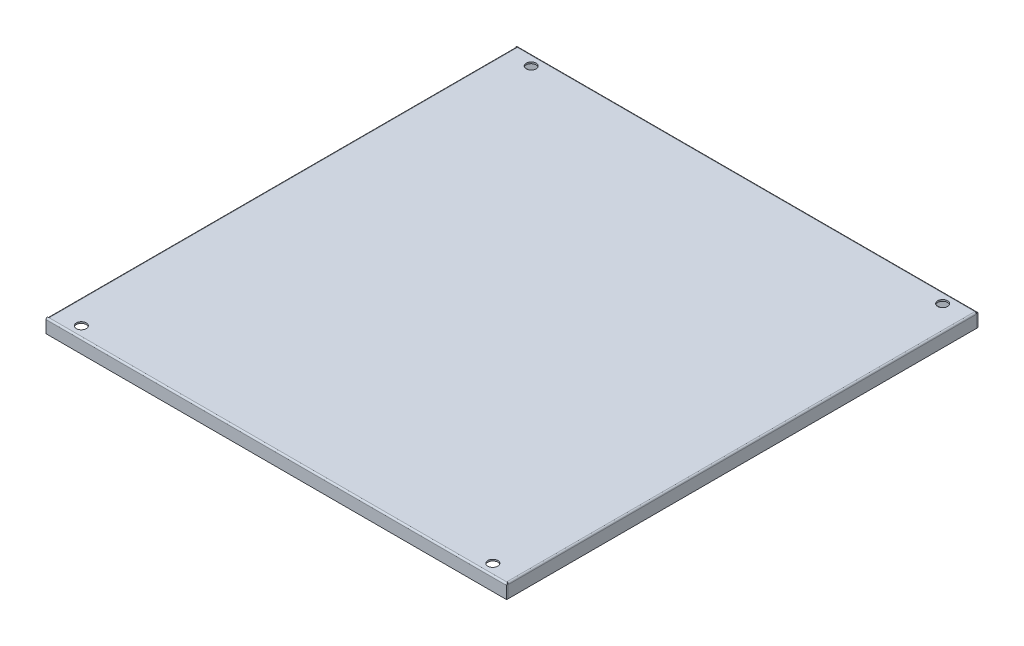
ISO-10303-21;
HEADER;
FILE_DESCRIPTION(('STEP AP214'),'2;1');
FILE_NAME('part.step','',(''),(''),'','','');
FILE_SCHEMA(('AUTOMOTIVE_DESIGN { 1 0 10303 214 1 1 1 1 }'));
ENDSEC;
DATA;
#1=APPLICATION_CONTEXT('core data for automotive mechanical design processes');
#2=APPLICATION_PROTOCOL_DEFINITION('international standard','automotive_design',2000,#1);
#3=PRODUCT_CONTEXT('',#1,'mechanical');
#4=PRODUCT('Part','Part','',(#3));
#5=PRODUCT_RELATED_PRODUCT_CATEGORY('part','',(#4));
#6=PRODUCT_DEFINITION_FORMATION('','',#4);
#7=PRODUCT_DEFINITION_CONTEXT('part definition',#1,'design');
#8=PRODUCT_DEFINITION('design','',#6,#7);
#9=PRODUCT_DEFINITION_SHAPE('','',#8);
#10=(LENGTH_UNIT() NAMED_UNIT(*) SI_UNIT(.MILLI.,.METRE.));
#11=(NAMED_UNIT(*) PLANE_ANGLE_UNIT() SI_UNIT($,.RADIAN.));
#12=(NAMED_UNIT(*) SI_UNIT($,.STERADIAN.) SOLID_ANGLE_UNIT());
#13=UNCERTAINTY_MEASURE_WITH_UNIT(LENGTH_MEASURE(1.E-05),#10,'distance_accuracy_value','');
#14=(GEOMETRIC_REPRESENTATION_CONTEXT(3) GLOBAL_UNCERTAINTY_ASSIGNED_CONTEXT((#13)) GLOBAL_UNIT_ASSIGNED_CONTEXT((#10,
#11,#12)) REPRESENTATION_CONTEXT('',''));
#15=CARTESIAN_POINT('',(0.,0.,0.));
#16=DIRECTION('',(0.,0.,1.));
#17=DIRECTION('',(1.,0.,0.));
#18=AXIS2_PLACEMENT_3D('',#15,#16,#17);
#19=CARTESIAN_POINT('',(300.,0.,304.95));
#20=DIRECTION('',(0.,0.,-1.));
#21=DIRECTION('',(0.,1.,0.));
#22=AXIS2_PLACEMENT_3D('',#19,#20,#21);
#23=PLANE('',#22);
#24=DIRECTION('',(0.,1.,0.));
#25=VECTOR('',#24,1.);
#26=CARTESIAN_POINT('',(300.,0.,304.95));
#27=LINE('',#26,#25);
#28=CARTESIAN_POINT('',(299.999390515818,-1.48654678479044E-05,304.95));
#29=VERTEX_POINT('',#28);
#30=CARTESIAN_POINT('',(300.,2.,304.95));
#31=VERTEX_POINT('',#30);
#32=EDGE_CURVE('E521',#29,#31,#27,.T.);
#33=ORIENTED_EDGE('',*,*,#32,.F.);
#34=CARTESIAN_POINT('',(297.95,-0.0499999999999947,304.95));
#35=DIRECTION('',(0.,0.,1.));
#36=DIRECTION('',(1.,0.,0.));
#37=AXIS2_PLACEMENT_3D('',#34,#35,#36);
#38=CIRCLE('',#37,2.04999999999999);
#39=CARTESIAN_POINT('',(297.95,2.,304.95));
#40=VERTEX_POINT('',#39);
#41=EDGE_CURVE('E13',#29,#40,#38,.T.);
#42=ORIENTED_EDGE('',*,*,#41,.T.);
#43=DIRECTION('',(-1.,0.,0.));
#44=VECTOR('',#43,1.);
#45=CARTESIAN_POINT('',(-300.,2.,304.95));
#46=LINE('',#45,#44);
#47=EDGE_CURVE('E464',#31,#40,#46,.T.);
#48=ORIENTED_EDGE('',*,*,#47,.F.);
#49=EDGE_LOOP('',(#33,#42,#48));
#50=FACE_BOUND('',#49,.T.);
#51=ADVANCED_FACE('F119',(#50),#23,.T.);
#52=CARTESIAN_POINT('',(297.95,0.,-304.95));
#53=DIRECTION('',(1.62471662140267E-13,0.,1.));
#54=DIRECTION('',(1.,0.,-1.62471662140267E-13));
#55=AXIS2_PLACEMENT_3D('',#52,#53,#54);
#56=PLANE('',#55);
#57=DIRECTION('',(1.,0.,0.));
#58=VECTOR('',#57,1.);
#59=CARTESIAN_POINT('',(300.,2.,-304.95));
#60=LINE('',#59,#58);
#61=CARTESIAN_POINT('',(300.,2.,-304.95));
#62=VERTEX_POINT('',#61);
#63=CARTESIAN_POINT('',(297.95,2.,-304.949999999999));
#64=VERTEX_POINT('',#63);
#65=EDGE_CURVE('E493',#62,#64,#60,.F.);
#66=ORIENTED_EDGE('',*,*,#65,.T.);
#67=CARTESIAN_POINT('',(297.95,-0.0499999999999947,-304.949999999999));
#68=DIRECTION('',(0.,0.,1.));
#69=DIRECTION('',(1.,0.,0.));
#70=AXIS2_PLACEMENT_3D('',#67,#68,#69);
#71=CIRCLE('',#70,2.04999999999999);
#72=CARTESIAN_POINT('',(299.999390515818,-1.48654678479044E-05,-304.949999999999));
#73=VERTEX_POINT('',#72);
#74=EDGE_CURVE('E392',#64,#73,#71,.F.);
#75=ORIENTED_EDGE('',*,*,#74,.T.);
#76=DIRECTION('',(0.,1.,0.));
#77=VECTOR('',#76,1.);
#78=CARTESIAN_POINT('',(300.,0.,-304.95));
#79=LINE('',#78,#77);
#80=EDGE_CURVE('E499',#73,#62,#79,.T.);
#81=ORIENTED_EDGE('',*,*,#80,.T.);
#82=EDGE_LOOP('',(#66,#75,#81));
#83=FACE_BOUND('',#82,.T.);
#84=ADVANCED_FACE('F591',(#83),#56,.T.);
#85=CARTESIAN_POINT('',(-300.,0.,-304.95));
#86=DIRECTION('',(0.,0.,1.));
#87=DIRECTION('',(0.,-1.,0.));
#88=AXIS2_PLACEMENT_3D('',#85,#86,#87);
#89=PLANE('',#88);
#90=DIRECTION('',(0.,1.,0.));
#91=VECTOR('',#90,1.);
#92=CARTESIAN_POINT('',(-300.,0.,-304.95));
#93=LINE('',#92,#91);
#94=CARTESIAN_POINT('',(-299.999390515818,-1.48654678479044E-05,-304.95));
#95=VERTEX_POINT('',#94);
#96=CARTESIAN_POINT('',(-300.,2.,-304.95));
#97=VERTEX_POINT('',#96);
#98=EDGE_CURVE('E514',#95,#97,#93,.T.);
#99=ORIENTED_EDGE('',*,*,#98,.F.);
#100=CARTESIAN_POINT('',(-297.95,-0.0499999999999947,-304.95));
#101=DIRECTION('',(0.,0.,-1.));
#102=DIRECTION('',(-1.,0.,0.));
#103=AXIS2_PLACEMENT_3D('',#100,#101,#102);
#104=CIRCLE('',#103,2.04999999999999);
#105=CARTESIAN_POINT('',(-297.95,2.,-304.95));
#106=VERTEX_POINT('',#105);
#107=EDGE_CURVE('E128',#95,#106,#104,.T.);
#108=ORIENTED_EDGE('',*,*,#107,.T.);
#109=DIRECTION('',(1.,0.,0.));
#110=VECTOR('',#109,1.);
#111=CARTESIAN_POINT('',(300.,2.,-304.95));
#112=LINE('',#111,#110);
#113=EDGE_CURVE('E248',#97,#106,#112,.T.);
#114=ORIENTED_EDGE('',*,*,#113,.F.);
#115=EDGE_LOOP('',(#99,#108,#114));
#116=FACE_BOUND('',#115,.T.);
#117=ADVANCED_FACE('F597',(#116),#89,.T.);
#118=CARTESIAN_POINT('',(-297.95,0.,304.95));
#119=DIRECTION('',(-1.62471662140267E-13,0.,-1.));
#120=DIRECTION('',(-1.,0.,1.62471662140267E-13));
#121=AXIS2_PLACEMENT_3D('',#118,#119,#120);
#122=PLANE('',#121);
#123=DIRECTION('',(-1.,0.,0.));
#124=VECTOR('',#123,1.);
#125=CARTESIAN_POINT('',(-300.,2.,304.95));
#126=LINE('',#125,#124);
#127=CARTESIAN_POINT('',(-300.,2.,304.95));
#128=VERTEX_POINT('',#127);
#129=CARTESIAN_POINT('',(-297.95,2.,304.949999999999));
#130=VERTEX_POINT('',#129);
#131=EDGE_CURVE('E738',#128,#130,#126,.F.);
#132=ORIENTED_EDGE('',*,*,#131,.T.);
#133=CARTESIAN_POINT('',(-297.95,-0.0499999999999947,304.949999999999));
#134=DIRECTION('',(0.,0.,-1.));
#135=DIRECTION('',(-1.,0.,0.));
#136=AXIS2_PLACEMENT_3D('',#133,#134,#135);
#137=CIRCLE('',#136,2.04999999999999);
#138=CARTESIAN_POINT('',(-299.999390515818,-1.48654678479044E-05,304.949999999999));
#139=VERTEX_POINT('',#138);
#140=EDGE_CURVE('E449',#130,#139,#137,.F.);
#141=ORIENTED_EDGE('',*,*,#140,.T.);
#142=DIRECTION('',(0.,1.,0.));
#143=VECTOR('',#142,1.);
#144=CARTESIAN_POINT('',(-300.,0.,304.95));
#145=LINE('',#144,#143);
#146=EDGE_CURVE('E241',#139,#128,#145,.T.);
#147=ORIENTED_EDGE('',*,*,#146,.T.);
#148=EDGE_LOOP('',(#132,#141,#147));
#149=FACE_BOUND('',#148,.T.);
#150=ADVANCED_FACE('F602',(#149),#122,.T.);
#151=CARTESIAN_POINT('',(300.,2.,-307.));
#152=DIRECTION('',(0.,-1.,0.));
#153=DIRECTION('',(0.,0.,-1.));
#154=AXIS2_PLACEMENT_3D('',#151,#152,#153);
#155=PLANE('',#154);
#156=CARTESIAN_POINT('',(268.,2.,293.));
#157=DIRECTION('',(0.,1.,0.));
#158=DIRECTION('',(0.,0.,1.));
#159=AXIS2_PLACEMENT_3D('',#156,#157,#158);
#160=CIRCLE('',#159,6.50000000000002);
#161=CARTESIAN_POINT('',(268.,2.,299.5));
#162=VERTEX_POINT('',#161);
#163=EDGE_CURVE('E558',#162,#162,#160,.T.);
#164=ORIENTED_EDGE('',*,*,#163,.F.);
#165=EDGE_LOOP('',(#164));
#166=FACE_BOUND('',#165,.T.);
#167=CARTESIAN_POINT('',(-268.,2.,-293.));
#168=DIRECTION('',(0.,1.,0.));
#169=DIRECTION('',(0.,0.,1.));
#170=AXIS2_PLACEMENT_3D('',#167,#168,#169);
#171=CIRCLE('',#170,6.50000000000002);
#172=CARTESIAN_POINT('',(-268.,2.,-286.5));
#173=VERTEX_POINT('',#172);
#174=EDGE_CURVE('E568',#173,#173,#171,.T.);
#175=ORIENTED_EDGE('',*,*,#174,.F.);
#176=EDGE_LOOP('',(#175));
#177=FACE_BOUND('',#176,.T.);
#178=CARTESIAN_POINT('',(268.,2.,-293.));
#179=DIRECTION('',(0.,1.,0.));
#180=DIRECTION('',(0.,0.,-1.));
#181=AXIS2_PLACEMENT_3D('',#178,#179,#180);
#182=CIRCLE('',#181,6.50000000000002);
#183=CARTESIAN_POINT('',(268.,2.,-299.5));
#184=VERTEX_POINT('',#183);
#185=EDGE_CURVE('E564',#184,#184,#182,.T.);
#186=ORIENTED_EDGE('',*,*,#185,.F.);
#187=EDGE_LOOP('',(#186));
#188=FACE_BOUND('',#187,.T.);
#189=CARTESIAN_POINT('',(-268.,2.,293.));
#190=DIRECTION('',(0.,1.,0.));
#191=DIRECTION('',(0.,0.,-1.));
#192=AXIS2_PLACEMENT_3D('',#189,#190,#191);
#193=CIRCLE('',#192,6.50000000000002);
#194=CARTESIAN_POINT('',(-268.,2.,286.5));
#195=VERTEX_POINT('',#194);
#196=EDGE_CURVE('E552',#195,#195,#193,.T.);
#197=ORIENTED_EDGE('',*,*,#196,.F.);
#198=EDGE_LOOP('',(#197));
#199=FACE_BOUND('',#198,.T.);
#200=DIRECTION('',(0.,0.,1.));
#201=VECTOR('',#200,1.);
#202=CARTESIAN_POINT('',(297.95,2.,304.95));
#203=LINE('',#202,#201);
#204=EDGE_CURVE('E382',#40,#64,#203,.F.);
#205=ORIENTED_EDGE('',*,*,#204,.T.);
#206=EDGE_CURVE('E497',#64,#106,#60,.F.);
#207=ORIENTED_EDGE('',*,*,#206,.T.);
#208=DIRECTION('',(0.,0.,-1.));
#209=VECTOR('',#208,1.);
#210=CARTESIAN_POINT('',(-297.95,2.,-304.95));
#211=LINE('',#210,#209);
#212=EDGE_CURVE('E438',#106,#130,#211,.F.);
#213=ORIENTED_EDGE('',*,*,#212,.T.);
#214=EDGE_CURVE('E535',#130,#40,#126,.F.);
#215=ORIENTED_EDGE('',*,*,#214,.T.);
#216=EDGE_LOOP('',(#205,#207,#213,#215));
#217=FACE_BOUND('',#216,.T.);
#218=ADVANCED_FACE('F588',(#166,#177,#188,#199,#217),#155,.F.);
#219=CARTESIAN_POINT('',(300.,0.,-307.));
#220=DIRECTION('',(0.,-1.,0.));
#221=DIRECTION('',(0.,0.,-1.));
#222=AXIS2_PLACEMENT_3D('',#219,#220,#221);
#223=PLANE('',#222);
#224=CARTESIAN_POINT('',(268.,0.,293.));
#225=DIRECTION('',(0.,1.,0.));
#226=DIRECTION('',(0.,0.,1.));
#227=AXIS2_PLACEMENT_3D('',#224,#225,#226);
#228=CIRCLE('',#227,6.50000000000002);
#229=CARTESIAN_POINT('',(268.,0.,299.5));
#230=VERTEX_POINT('',#229);
#231=EDGE_CURVE('E555',#230,#230,#228,.T.);
#232=ORIENTED_EDGE('',*,*,#231,.T.);
#233=EDGE_LOOP('',(#232));
#234=FACE_BOUND('',#233,.T.);
#235=CARTESIAN_POINT('',(-268.,0.,-293.));
#236=DIRECTION('',(0.,1.,0.));
#237=DIRECTION('',(0.,0.,1.));
#238=AXIS2_PLACEMENT_3D('',#235,#236,#237);
#239=CIRCLE('',#238,6.50000000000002);
#240=CARTESIAN_POINT('',(-268.,0.,-286.5));
#241=VERTEX_POINT('',#240);
#242=EDGE_CURVE('E546',#241,#241,#239,.T.);
#243=ORIENTED_EDGE('',*,*,#242,.T.);
#244=EDGE_LOOP('',(#243));
#245=FACE_BOUND('',#244,.T.);
#246=CARTESIAN_POINT('',(268.,0.,-293.));
#247=DIRECTION('',(0.,1.,0.));
#248=DIRECTION('',(0.,0.,-1.));
#249=AXIS2_PLACEMENT_3D('',#246,#247,#248);
#250=CIRCLE('',#249,6.50000000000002);
#251=CARTESIAN_POINT('',(268.,0.,-299.5));
#252=VERTEX_POINT('',#251);
#253=EDGE_CURVE('E561',#252,#252,#250,.T.);
#254=ORIENTED_EDGE('',*,*,#253,.T.);
#255=EDGE_LOOP('',(#254));
#256=FACE_BOUND('',#255,.T.);
#257=CARTESIAN_POINT('',(-268.,0.,293.));
#258=DIRECTION('',(0.,1.,0.));
#259=DIRECTION('',(0.,0.,-1.));
#260=AXIS2_PLACEMENT_3D('',#257,#258,#259);
#261=CIRCLE('',#260,6.50000000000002);
#262=CARTESIAN_POINT('',(-268.,0.,286.5));
#263=VERTEX_POINT('',#262);
#264=EDGE_CURVE('E524',#263,#263,#261,.T.);
#265=ORIENTED_EDGE('',*,*,#264,.T.);
#266=EDGE_LOOP('',(#265));
#267=FACE_BOUND('',#266,.T.);
#268=DIRECTION('',(1.,0.,0.));
#269=VECTOR('',#268,1.);
#270=CARTESIAN_POINT('',(300.,0.,-304.95));
#271=LINE('',#270,#269);
#272=CARTESIAN_POINT('',(297.95,0.,-304.95));
#273=VERTEX_POINT('',#272);
#274=CARTESIAN_POINT('',(-297.95,0.,-304.95));
#275=VERTEX_POINT('',#274);
#276=EDGE_CURVE('E502',#273,#275,#271,.F.);
#277=ORIENTED_EDGE('',*,*,#276,.F.);
#278=DIRECTION('',(0.,0.,1.));
#279=VECTOR('',#278,1.);
#280=CARTESIAN_POINT('',(297.95,0.,304.95));
#281=LINE('',#280,#279);
#282=CARTESIAN_POINT('',(297.95,0.,304.95));
#283=VERTEX_POINT('',#282);
#284=EDGE_CURVE('E398',#283,#273,#281,.F.);
#285=ORIENTED_EDGE('',*,*,#284,.F.);
#286=DIRECTION('',(-1.,0.,0.));
#287=VECTOR('',#286,1.);
#288=CARTESIAN_POINT('',(-300.,0.,304.95));
#289=LINE('',#288,#287);
#290=CARTESIAN_POINT('',(-297.95,0.,304.95));
#291=VERTEX_POINT('',#290);
#292=EDGE_CURVE('E538',#291,#283,#289,.F.);
#293=ORIENTED_EDGE('',*,*,#292,.F.);
#294=DIRECTION('',(0.,0.,-1.));
#295=VECTOR('',#294,1.);
#296=CARTESIAN_POINT('',(-297.95,0.,-304.95));
#297=LINE('',#296,#295);
#298=EDGE_CURVE('E455',#275,#291,#297,.F.);
#299=ORIENTED_EDGE('',*,*,#298,.F.);
#300=EDGE_LOOP('',(#277,#285,#293,#299));
#301=FACE_BOUND('',#300,.T.);
#302=ADVANCED_FACE('F121',(#234,#245,#256,#267,#301),#223,.T.);
#303=CARTESIAN_POINT('',(-268.,2.,-293.));
#304=DIRECTION('',(0.,-1.,0.));
#305=DIRECTION('',(0.,0.,-1.));
#306=AXIS2_PLACEMENT_3D('',#303,#304,#305);
#307=CYLINDRICAL_SURFACE('',#306,6.50000000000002);
#308=ORIENTED_EDGE('',*,*,#174,.T.);
#309=EDGE_LOOP('',(#308));
#310=FACE_BOUND('',#309,.T.);
#311=ORIENTED_EDGE('',*,*,#242,.F.);
#312=EDGE_LOOP('',(#311));
#313=FACE_BOUND('',#312,.T.);
#314=ADVANCED_FACE('F577',(#310,#313),#307,.F.);
#315=CARTESIAN_POINT('',(268.,2.,-293.));
#316=DIRECTION('',(0.,-1.,0.));
#317=DIRECTION('',(0.,0.,-1.));
#318=AXIS2_PLACEMENT_3D('',#315,#316,#317);
#319=CYLINDRICAL_SURFACE('',#318,6.50000000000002);
#320=ORIENTED_EDGE('',*,*,#185,.T.);
#321=EDGE_LOOP('',(#320));
#322=FACE_BOUND('',#321,.T.);
#323=ORIENTED_EDGE('',*,*,#253,.F.);
#324=EDGE_LOOP('',(#323));
#325=FACE_BOUND('',#324,.T.);
#326=ADVANCED_FACE('F579',(#322,#325),#319,.F.);
#327=CARTESIAN_POINT('',(268.,2.,293.));
#328=DIRECTION('',(0.,-1.,0.));
#329=DIRECTION('',(0.,0.,-1.));
#330=AXIS2_PLACEMENT_3D('',#327,#328,#329);
#331=CYLINDRICAL_SURFACE('',#330,6.50000000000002);
#332=ORIENTED_EDGE('',*,*,#163,.T.);
#333=EDGE_LOOP('',(#332));
#334=FACE_BOUND('',#333,.T.);
#335=ORIENTED_EDGE('',*,*,#231,.F.);
#336=EDGE_LOOP('',(#335));
#337=FACE_BOUND('',#336,.T.);
#338=ADVANCED_FACE('F585',(#334,#337),#331,.F.);
#339=CARTESIAN_POINT('',(-268.,2.,293.));
#340=DIRECTION('',(0.,-1.,0.));
#341=DIRECTION('',(0.,0.,-1.));
#342=AXIS2_PLACEMENT_3D('',#339,#340,#341);
#343=CYLINDRICAL_SURFACE('',#342,6.50000000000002);
#344=ORIENTED_EDGE('',*,*,#196,.T.);
#345=EDGE_LOOP('',(#344));
#346=FACE_BOUND('',#345,.T.);
#347=ORIENTED_EDGE('',*,*,#264,.F.);
#348=EDGE_LOOP('',(#347));
#349=FACE_BOUND('',#348,.T.);
#350=ADVANCED_FACE('F668',(#346,#349),#343,.F.);
#351=CARTESIAN_POINT('',(300.,-0.0499999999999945,304.95));
#352=DIRECTION('',(1.,0.,0.));
#353=DIRECTION('',(0.,0.,-1.));
#354=AXIS2_PLACEMENT_3D('',#351,#352,#353);
#355=PLANE('',#354);
#356=DIRECTION('',(0.,0.,1.));
#357=VECTOR('',#356,1.);
#358=CARTESIAN_POINT('',(300.,-0.0499999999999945,307.));
#359=LINE('',#358,#357);
#360=CARTESIAN_POINT('',(300.,-0.0499999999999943,305.));
#361=VERTEX_POINT('',#360);
#362=CARTESIAN_POINT('',(300.,-0.0499999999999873,307.));
#363=VERTEX_POINT('',#362);
#364=EDGE_CURVE('E157',#361,#363,#359,.T.);
#365=ORIENTED_EDGE('',*,*,#364,.F.);
#366=CARTESIAN_POINT('',(300.,-0.0499999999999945,304.95));
#367=DIRECTION('',(-1.,0.,0.));
#368=DIRECTION('',(0.,0.,1.));
#369=AXIS2_PLACEMENT_3D('',#366,#367,#368);
#370=CIRCLE('',#369,0.0499999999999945);
#371=EDGE_CURVE('E530',#29,#361,#370,.F.);
#372=ORIENTED_EDGE('',*,*,#371,.F.);
#373=ORIENTED_EDGE('',*,*,#32,.T.);
#374=CARTESIAN_POINT('',(300.,-0.0499999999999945,304.95));
#375=DIRECTION('',(-1.,0.,0.));
#376=DIRECTION('',(0.,0.,1.));
#377=AXIS2_PLACEMENT_3D('',#374,#375,#376);
#378=CIRCLE('',#377,2.04999999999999);
#379=EDGE_CURVE('E739',#31,#363,#378,.F.);
#380=ORIENTED_EDGE('',*,*,#379,.T.);
#381=EDGE_LOOP('',(#365,#372,#373,#380));
#382=FACE_BOUND('',#381,.T.);
#383=ADVANCED_FACE('F665',(#382),#355,.T.);
#384=CARTESIAN_POINT('',(-300.,-0.0499999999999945,304.95));
#385=DIRECTION('',(1.,0.,0.));
#386=DIRECTION('',(0.,0.,-1.));
#387=AXIS2_PLACEMENT_3D('',#384,#385,#386);
#388=PLANE('',#387);
#389=CARTESIAN_POINT('',(-300.,-0.0499999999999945,304.95));
#390=DIRECTION('',(-1.,0.,0.));
#391=DIRECTION('',(0.,0.,1.));
#392=AXIS2_PLACEMENT_3D('',#389,#390,#391);
#393=CIRCLE('',#392,0.0499999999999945);
#394=CARTESIAN_POINT('',(-300.,-0.0499999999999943,305.));
#395=VERTEX_POINT('',#394);
#396=EDGE_CURVE('E542',#395,#139,#393,.T.);
#397=ORIENTED_EDGE('',*,*,#396,.F.);
#398=DIRECTION('',(0.,0.,1.));
#399=VECTOR('',#398,1.);
#400=CARTESIAN_POINT('',(-300.,-0.0499999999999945,305.));
#401=LINE('',#400,#399);
#402=CARTESIAN_POINT('',(-300.,-0.0499999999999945,307.));
#403=VERTEX_POINT('',#402);
#404=EDGE_CURVE('E733',#395,#403,#401,.T.);
#405=ORIENTED_EDGE('',*,*,#404,.T.);
#406=CARTESIAN_POINT('',(-300.,-0.0499999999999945,304.95));
#407=DIRECTION('',(-1.,0.,0.));
#408=DIRECTION('',(0.,0.,1.));
#409=AXIS2_PLACEMENT_3D('',#406,#407,#408);
#410=CIRCLE('',#409,2.04999999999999);
#411=EDGE_CURVE('E163',#403,#128,#410,.T.);
#412=ORIENTED_EDGE('',*,*,#411,.T.);
#413=ORIENTED_EDGE('',*,*,#146,.F.);
#414=EDGE_LOOP('',(#397,#405,#412,#413));
#415=FACE_BOUND('',#414,.T.);
#416=ADVANCED_FACE('F662',(#415),#388,.F.);
#417=CARTESIAN_POINT('',(-300.,-0.0499999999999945,304.95));
#418=DIRECTION('',(-1.,0.,0.));
#419=DIRECTION('',(0.,0.,1.));
#420=AXIS2_PLACEMENT_3D('',#417,#418,#419);
#421=CYLINDRICAL_SURFACE('',#420,2.04999999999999);
#422=ORIENTED_EDGE('',*,*,#131,.F.);
#423=ORIENTED_EDGE('',*,*,#411,.F.);
#424=DIRECTION('',(-1.,0.,0.));
#425=VECTOR('',#424,1.);
#426=CARTESIAN_POINT('',(-300.,-0.0499999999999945,307.));
#427=LINE('',#426,#425);
#428=EDGE_CURVE('E144',#363,#403,#427,.T.);
#429=ORIENTED_EDGE('',*,*,#428,.F.);
#430=ORIENTED_EDGE('',*,*,#379,.F.);
#431=ORIENTED_EDGE('',*,*,#47,.T.);
#432=ORIENTED_EDGE('',*,*,#214,.F.);
#433=EDGE_LOOP('',(#422,#423,#429,#430,#431,#432));
#434=FACE_BOUND('',#433,.T.);
#435=ADVANCED_FACE('F659',(#434),#421,.T.);
#436=CARTESIAN_POINT('',(-300.,-0.0499999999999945,304.95));
#437=DIRECTION('',(-1.,0.,0.));
#438=DIRECTION('',(0.,0.,1.));
#439=AXIS2_PLACEMENT_3D('',#436,#437,#438);
#440=CYLINDRICAL_SURFACE('',#439,0.0499999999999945);
#441=EDGE_CURVE('E531',#139,#291,#289,.F.);
#442=ORIENTED_EDGE('',*,*,#441,.T.);
#443=ORIENTED_EDGE('',*,*,#292,.T.);
#444=DIRECTION('',(-1.,0.,0.));
#445=VECTOR('',#444,1.);
#446=CARTESIAN_POINT('',(300.,0.,304.95));
#447=LINE('',#446,#445);
#448=EDGE_CURVE('E468',#29,#283,#447,.T.);
#449=ORIENTED_EDGE('',*,*,#448,.F.);
#450=ORIENTED_EDGE('',*,*,#371,.T.);
#451=DIRECTION('',(1.,0.,0.));
#452=VECTOR('',#451,1.);
#453=CARTESIAN_POINT('',(300.,-0.0499999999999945,305.));
#454=LINE('',#453,#452);
#455=EDGE_CURVE('E735',#361,#395,#454,.F.);
#456=ORIENTED_EDGE('',*,*,#455,.T.);
#457=ORIENTED_EDGE('',*,*,#396,.T.);
#458=EDGE_LOOP('',(#442,#443,#449,#450,#456,#457));
#459=FACE_BOUND('',#458,.T.);
#460=ADVANCED_FACE('F652',(#459),#440,.F.);
#461=CARTESIAN_POINT('',(-300.,0.,307.));
#462=DIRECTION('',(-1.,0.,0.));
#463=DIRECTION('',(0.,0.,1.));
#464=AXIS2_PLACEMENT_3D('',#461,#462,#463);
#465=PLANE('',#464);
#466=DIRECTION('',(0.,1.,0.));
#467=VECTOR('',#466,1.);
#468=CARTESIAN_POINT('',(-300.,0.,307.));
#469=LINE('',#468,#467);
#470=CARTESIAN_POINT('',(-300.,-16.,307.));
#471=VERTEX_POINT('',#470);
#472=EDGE_CURVE('E717',#471,#403,#469,.T.);
#473=ORIENTED_EDGE('',*,*,#472,.T.);
#474=ORIENTED_EDGE('',*,*,#404,.F.);
#475=DIRECTION('',(0.,-1.,0.));
#476=VECTOR('',#475,1.);
#477=CARTESIAN_POINT('',(-300.,0.,305.));
#478=LINE('',#477,#476);
#479=CARTESIAN_POINT('',(-300.,-16.,305.));
#480=VERTEX_POINT('',#479);
#481=EDGE_CURVE('E726',#480,#395,#478,.F.);
#482=ORIENTED_EDGE('',*,*,#481,.F.);
#483=DIRECTION('',(0.,0.,-1.));
#484=VECTOR('',#483,1.);
#485=CARTESIAN_POINT('',(-300.,-16.,307.));
#486=LINE('',#485,#484);
#487=EDGE_CURVE('E178',#471,#480,#486,.T.);
#488=ORIENTED_EDGE('',*,*,#487,.F.);
#489=EDGE_LOOP('',(#473,#474,#482,#488));
#490=FACE_BOUND('',#489,.T.);
#491=ADVANCED_FACE('F649',(#490),#465,.T.);
#492=CARTESIAN_POINT('',(300.,-16.,307.));
#493=DIRECTION('',(1.,0.,0.));
#494=DIRECTION('',(0.,0.,-1.));
#495=AXIS2_PLACEMENT_3D('',#492,#493,#494);
#496=PLANE('',#495);
#497=DIRECTION('',(0.,1.,0.));
#498=VECTOR('',#497,1.);
#499=CARTESIAN_POINT('',(300.,0.,305.));
#500=LINE('',#499,#498);
#501=CARTESIAN_POINT('',(300.,-16.,305.));
#502=VERTEX_POINT('',#501);
#503=EDGE_CURVE('E185',#361,#502,#500,.F.);
#504=ORIENTED_EDGE('',*,*,#503,.F.);
#505=ORIENTED_EDGE('',*,*,#364,.T.);
#506=DIRECTION('',(0.,-1.,0.));
#507=VECTOR('',#506,1.);
#508=CARTESIAN_POINT('',(300.,-16.,307.));
#509=LINE('',#508,#507);
#510=CARTESIAN_POINT('',(300.,-16.,307.));
#511=VERTEX_POINT('',#510);
#512=EDGE_CURVE('E724',#363,#511,#509,.T.);
#513=ORIENTED_EDGE('',*,*,#512,.T.);
#514=DIRECTION('',(0.,0.,-1.));
#515=VECTOR('',#514,1.);
#516=CARTESIAN_POINT('',(300.,-16.,307.));
#517=LINE('',#516,#515);
#518=EDGE_CURVE('E716',#511,#502,#517,.T.);
#519=ORIENTED_EDGE('',*,*,#518,.T.);
#520=EDGE_LOOP('',(#504,#505,#513,#519));
#521=FACE_BOUND('',#520,.T.);
#522=ADVANCED_FACE('F645',(#521),#496,.T.);
#523=CARTESIAN_POINT('',(-300.,0.,307.));
#524=DIRECTION('',(0.,0.,1.));
#525=DIRECTION('',(0.,-1.,0.));
#526=AXIS2_PLACEMENT_3D('',#523,#524,#525);
#527=PLANE('',#526);
#528=ORIENTED_EDGE('',*,*,#512,.F.);
#529=ORIENTED_EDGE('',*,*,#428,.T.);
#530=ORIENTED_EDGE('',*,*,#472,.F.);
#531=DIRECTION('',(-1.,0.,0.));
#532=VECTOR('',#531,1.);
#533=CARTESIAN_POINT('',(-300.,-16.,307.));
#534=LINE('',#533,#532);
#535=EDGE_CURVE('E720',#511,#471,#534,.T.);
#536=ORIENTED_EDGE('',*,*,#535,.F.);
#537=EDGE_LOOP('',(#528,#529,#530,#536));
#538=FACE_BOUND('',#537,.T.);
#539=ADVANCED_FACE('F641',(#538),#527,.T.);
#540=CARTESIAN_POINT('',(-300.,0.,305.));
#541=DIRECTION('',(0.,0.,1.));
#542=DIRECTION('',(0.,-1.,0.));
#543=AXIS2_PLACEMENT_3D('',#540,#541,#542);
#544=PLANE('',#543);
#545=ORIENTED_EDGE('',*,*,#455,.F.);
#546=ORIENTED_EDGE('',*,*,#503,.T.);
#547=DIRECTION('',(1.,0.,0.));
#548=VECTOR('',#547,1.);
#549=CARTESIAN_POINT('',(-300.,-16.,305.));
#550=LINE('',#549,#548);
#551=EDGE_CURVE('E729',#502,#480,#550,.F.);
#552=ORIENTED_EDGE('',*,*,#551,.T.);
#553=ORIENTED_EDGE('',*,*,#481,.T.);
#554=EDGE_LOOP('',(#545,#546,#552,#553));
#555=FACE_BOUND('',#554,.T.);
#556=ADVANCED_FACE('F644',(#555),#544,.F.);
#557=CARTESIAN_POINT('',(-300.,-16.,307.));
#558=DIRECTION('',(0.,-1.,0.));
#559=DIRECTION('',(0.,0.,-1.));
#560=AXIS2_PLACEMENT_3D('',#557,#558,#559);
#561=PLANE('',#560);
#562=ORIENTED_EDGE('',*,*,#551,.F.);
#563=ORIENTED_EDGE('',*,*,#518,.F.);
#564=ORIENTED_EDGE('',*,*,#535,.T.);
#565=ORIENTED_EDGE('',*,*,#487,.T.);
#566=EDGE_LOOP('',(#562,#563,#564,#565));
#567=FACE_BOUND('',#566,.T.);
#568=ADVANCED_FACE('F637',(#567),#561,.T.);
#569=CARTESIAN_POINT('',(-300.,-0.0499999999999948,-304.95));
#570=DIRECTION('',(-1.,0.,0.));
#571=DIRECTION('',(0.,0.,1.));
#572=AXIS2_PLACEMENT_3D('',#569,#570,#571);
#573=PLANE('',#572);
#574=DIRECTION('',(0.,0.,-1.));
#575=VECTOR('',#574,1.);
#576=CARTESIAN_POINT('',(-300.,-0.0499999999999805,-307.));
#577=LINE('',#576,#575);
#578=CARTESIAN_POINT('',(-300.,-0.0499999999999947,-305.));
#579=VERTEX_POINT('',#578);
#580=CARTESIAN_POINT('',(-300.,-0.0499999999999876,-307.));
#581=VERTEX_POINT('',#580);
#582=EDGE_CURVE('E205',#579,#581,#577,.T.);
#583=ORIENTED_EDGE('',*,*,#582,.F.);
#584=CARTESIAN_POINT('',(-300.,-0.0499999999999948,-304.95));
#585=DIRECTION('',(1.,0.,0.));
#586=DIRECTION('',(0.,0.,-1.));
#587=AXIS2_PLACEMENT_3D('',#584,#585,#586);
#588=CIRCLE('',#587,0.0499999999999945);
#589=EDGE_CURVE('E501',#95,#579,#588,.F.);
#590=ORIENTED_EDGE('',*,*,#589,.F.);
#591=ORIENTED_EDGE('',*,*,#98,.T.);
#592=CARTESIAN_POINT('',(-300.,-0.0499999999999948,-304.95));
#593=DIRECTION('',(1.,0.,0.));
#594=DIRECTION('',(0.,0.,-1.));
#595=AXIS2_PLACEMENT_3D('',#592,#593,#594);
#596=CIRCLE('',#595,2.04999999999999);
#597=EDGE_CURVE('E496',#97,#581,#596,.F.);
#598=ORIENTED_EDGE('',*,*,#597,.T.);
#599=EDGE_LOOP('',(#583,#590,#591,#598));
#600=FACE_BOUND('',#599,.T.);
#601=ADVANCED_FACE('F634',(#600),#573,.T.);
#602=CARTESIAN_POINT('',(300.,-0.0499999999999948,-304.95));
#603=DIRECTION('',(-1.,0.,0.));
#604=DIRECTION('',(0.,0.,1.));
#605=AXIS2_PLACEMENT_3D('',#602,#603,#604);
#606=PLANE('',#605);
#607=CARTESIAN_POINT('',(300.,-0.0499999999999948,-304.95));
#608=DIRECTION('',(1.,0.,0.));
#609=DIRECTION('',(0.,0.,-1.));
#610=AXIS2_PLACEMENT_3D('',#607,#608,#609);
#611=CIRCLE('',#610,0.0499999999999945);
#612=CARTESIAN_POINT('',(300.,-0.0499999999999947,-305.));
#613=VERTEX_POINT('',#612);
#614=EDGE_CURVE('E471',#613,#73,#611,.T.);
#615=ORIENTED_EDGE('',*,*,#614,.F.);
#616=DIRECTION('',(0.,0.,-1.));
#617=VECTOR('',#616,1.);
#618=CARTESIAN_POINT('',(300.,-0.0499999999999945,-305.));
#619=LINE('',#618,#617);
#620=CARTESIAN_POINT('',(300.,-0.0499999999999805,-307.));
#621=VERTEX_POINT('',#620);
#622=EDGE_CURVE('E488',#613,#621,#619,.T.);
#623=ORIENTED_EDGE('',*,*,#622,.T.);
#624=CARTESIAN_POINT('',(300.,-0.0499999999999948,-304.95));
#625=DIRECTION('',(1.,0.,0.));
#626=DIRECTION('',(0.,0.,-1.));
#627=AXIS2_PLACEMENT_3D('',#624,#625,#626);
#628=CIRCLE('',#627,2.04999999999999);
#629=EDGE_CURVE('E233',#621,#62,#628,.T.);
#630=ORIENTED_EDGE('',*,*,#629,.T.);
#631=ORIENTED_EDGE('',*,*,#80,.F.);
#632=EDGE_LOOP('',(#615,#623,#630,#631));
#633=FACE_BOUND('',#632,.T.);
#634=ADVANCED_FACE('F630',(#633),#606,.F.);
#635=CARTESIAN_POINT('',(300.,-0.0499999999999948,-304.95));
#636=DIRECTION('',(1.,0.,0.));
#637=DIRECTION('',(0.,0.,-1.));
#638=AXIS2_PLACEMENT_3D('',#635,#636,#637);
#639=CYLINDRICAL_SURFACE('',#638,2.04999999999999);
#640=ORIENTED_EDGE('',*,*,#65,.F.);
#641=ORIENTED_EDGE('',*,*,#629,.F.);
#642=DIRECTION('',(1.,0.,0.));
#643=VECTOR('',#642,1.);
#644=CARTESIAN_POINT('',(-300.,-0.0499999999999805,-307.));
#645=LINE('',#644,#643);
#646=EDGE_CURVE('E193',#621,#581,#645,.F.);
#647=ORIENTED_EDGE('',*,*,#646,.T.);
#648=ORIENTED_EDGE('',*,*,#597,.F.);
#649=ORIENTED_EDGE('',*,*,#113,.T.);
#650=ORIENTED_EDGE('',*,*,#206,.F.);
#651=EDGE_LOOP('',(#640,#641,#647,#648,#649,#650));
#652=FACE_BOUND('',#651,.T.);
#653=ADVANCED_FACE('F627',(#652),#639,.T.);
#654=CARTESIAN_POINT('',(300.,-0.0499999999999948,-304.95));
#655=DIRECTION('',(1.,0.,0.));
#656=DIRECTION('',(0.,0.,-1.));
#657=AXIS2_PLACEMENT_3D('',#654,#655,#656);
#658=CYLINDRICAL_SURFACE('',#657,0.0499999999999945);
#659=EDGE_CURVE('E506',#73,#273,#271,.F.);
#660=ORIENTED_EDGE('',*,*,#659,.T.);
#661=ORIENTED_EDGE('',*,*,#276,.T.);
#662=DIRECTION('',(1.,0.,0.));
#663=VECTOR('',#662,1.);
#664=CARTESIAN_POINT('',(-300.,0.,-304.95));
#665=LINE('',#664,#663);
#666=EDGE_CURVE('E467',#95,#275,#665,.T.);
#667=ORIENTED_EDGE('',*,*,#666,.F.);
#668=ORIENTED_EDGE('',*,*,#589,.T.);
#669=DIRECTION('',(1.,0.,0.));
#670=VECTOR('',#669,1.);
#671=CARTESIAN_POINT('',(-300.,-0.0499999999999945,-305.));
#672=LINE('',#671,#670);
#673=EDGE_CURVE('E490',#579,#613,#672,.T.);
#674=ORIENTED_EDGE('',*,*,#673,.T.);
#675=ORIENTED_EDGE('',*,*,#614,.T.);
#676=EDGE_LOOP('',(#660,#661,#667,#668,#674,#675));
#677=FACE_BOUND('',#676,.T.);
#678=ADVANCED_FACE('F625',(#677),#658,.F.);
#679=CARTESIAN_POINT('',(-300.,0.,-307.));
#680=DIRECTION('',(-1.,0.,0.));
#681=DIRECTION('',(0.,0.,1.));
#682=AXIS2_PLACEMENT_3D('',#679,#680,#681);
#683=PLANE('',#682);
#684=DIRECTION('',(0.,-1.,0.));
#685=VECTOR('',#684,1.);
#686=CARTESIAN_POINT('',(-300.,-16.,-305.));
#687=LINE('',#686,#685);
#688=CARTESIAN_POINT('',(-300.,-16.,-305.));
#689=VERTEX_POINT('',#688);
#690=EDGE_CURVE('E229',#579,#689,#687,.T.);
#691=ORIENTED_EDGE('',*,*,#690,.F.);
#692=ORIENTED_EDGE('',*,*,#582,.T.);
#693=DIRECTION('',(0.,1.,0.));
#694=VECTOR('',#693,1.);
#695=CARTESIAN_POINT('',(-300.,0.,-307.));
#696=LINE('',#695,#694);
#697=CARTESIAN_POINT('',(-300.,-16.,-307.));
#698=VERTEX_POINT('',#697);
#699=EDGE_CURVE('E479',#581,#698,#696,.F.);
#700=ORIENTED_EDGE('',*,*,#699,.T.);
#701=DIRECTION('',(0.,0.,1.));
#702=VECTOR('',#701,1.);
#703=CARTESIAN_POINT('',(-300.,-16.,-307.));
#704=LINE('',#703,#702);
#705=EDGE_CURVE('E472',#698,#689,#704,.T.);
#706=ORIENTED_EDGE('',*,*,#705,.T.);
#707=EDGE_LOOP('',(#691,#692,#700,#706));
#708=FACE_BOUND('',#707,.T.);
#709=ADVANCED_FACE('F618',(#708),#683,.T.);
#710=CARTESIAN_POINT('',(300.,-15.9999999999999,-307.));
#711=DIRECTION('',(1.,0.,0.));
#712=DIRECTION('',(0.,0.,-1.));
#713=AXIS2_PLACEMENT_3D('',#710,#711,#712);
#714=PLANE('',#713);
#715=DIRECTION('',(0.,-1.,0.));
#716=VECTOR('',#715,1.);
#717=CARTESIAN_POINT('',(300.,-15.9999999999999,-307.));
#718=LINE('',#717,#716);
#719=CARTESIAN_POINT('',(300.,-15.9999999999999,-307.));
#720=VERTEX_POINT('',#719);
#721=EDGE_CURVE('E474',#720,#621,#718,.F.);
#722=ORIENTED_EDGE('',*,*,#721,.T.);
#723=ORIENTED_EDGE('',*,*,#622,.F.);
#724=DIRECTION('',(0.,1.,0.));
#725=VECTOR('',#724,1.);
#726=CARTESIAN_POINT('',(300.,-16.,-305.));
#727=LINE('',#726,#725);
#728=CARTESIAN_POINT('',(300.,-15.9999999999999,-305.));
#729=VERTEX_POINT('',#728);
#730=EDGE_CURVE('E481',#729,#613,#727,.T.);
#731=ORIENTED_EDGE('',*,*,#730,.F.);
#732=DIRECTION('',(0.,0.,1.));
#733=VECTOR('',#732,1.);
#734=CARTESIAN_POINT('',(300.,-15.9999999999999,-307.));
#735=LINE('',#734,#733);
#736=EDGE_CURVE('E214',#720,#729,#735,.T.);
#737=ORIENTED_EDGE('',*,*,#736,.F.);
#738=EDGE_LOOP('',(#722,#723,#731,#737));
#739=FACE_BOUND('',#738,.T.);
#740=ADVANCED_FACE('F611',(#739),#714,.T.);
#741=CARTESIAN_POINT('',(-300.,-16.,-307.));
#742=DIRECTION('',(0.,0.,1.));
#743=DIRECTION('',(0.,-1.,0.));
#744=AXIS2_PLACEMENT_3D('',#741,#742,#743);
#745=PLANE('',#744);
#746=ORIENTED_EDGE('',*,*,#646,.F.);
#747=ORIENTED_EDGE('',*,*,#721,.F.);
#748=DIRECTION('',(-1.,0.,0.));
#749=VECTOR('',#748,1.);
#750=CARTESIAN_POINT('',(-300.,-16.,-307.));
#751=LINE('',#750,#749);
#752=EDGE_CURVE('E476',#698,#720,#751,.F.);
#753=ORIENTED_EDGE('',*,*,#752,.F.);
#754=ORIENTED_EDGE('',*,*,#699,.F.);
#755=EDGE_LOOP('',(#746,#747,#753,#754));
#756=FACE_BOUND('',#755,.T.);
#757=ADVANCED_FACE('F607',(#756),#745,.F.);
#758=CARTESIAN_POINT('',(-300.,-16.,-305.));
#759=DIRECTION('',(0.,0.,1.));
#760=DIRECTION('',(0.,-1.,0.));
#761=AXIS2_PLACEMENT_3D('',#758,#759,#760);
#762=PLANE('',#761);
#763=ORIENTED_EDGE('',*,*,#730,.T.);
#764=ORIENTED_EDGE('',*,*,#673,.F.);
#765=ORIENTED_EDGE('',*,*,#690,.T.);
#766=DIRECTION('',(1.,0.,0.));
#767=VECTOR('',#766,1.);
#768=CARTESIAN_POINT('',(-300.,-16.,-305.));
#769=LINE('',#768,#767);
#770=EDGE_CURVE('E484',#689,#729,#769,.T.);
#771=ORIENTED_EDGE('',*,*,#770,.T.);
#772=EDGE_LOOP('',(#763,#764,#765,#771));
#773=FACE_BOUND('',#772,.T.);
#774=ADVANCED_FACE('F610',(#773),#762,.T.);
#775=CARTESIAN_POINT('',(-300.,-16.,-307.));
#776=DIRECTION('',(0.,-1.,0.));
#777=DIRECTION('',(0.,0.,-1.));
#778=AXIS2_PLACEMENT_3D('',#775,#776,#777);
#779=PLANE('',#778);
#780=ORIENTED_EDGE('',*,*,#770,.F.);
#781=ORIENTED_EDGE('',*,*,#705,.F.);
#782=ORIENTED_EDGE('',*,*,#752,.T.);
#783=ORIENTED_EDGE('',*,*,#736,.T.);
#784=EDGE_LOOP('',(#780,#781,#782,#783));
#785=FACE_BOUND('',#784,.T.);
#786=ADVANCED_FACE('F615',(#785),#779,.T.);
#787=CARTESIAN_POINT('',(-297.95,-0.0499999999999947,304.95));
#788=DIRECTION('',(0.,0.,1.));
#789=DIRECTION('',(1.,0.,0.));
#790=AXIS2_PLACEMENT_3D('',#787,#788,#789);
#791=PLANE('',#790);
#792=ORIENTED_EDGE('',*,*,#441,.F.);
#793=CARTESIAN_POINT('',(-300.,-0.0499999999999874,304.949999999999));
#794=VERTEX_POINT('',#793);
#795=EDGE_CURVE('E441',#139,#794,#137,.F.);
#796=ORIENTED_EDGE('',*,*,#795,.T.);
#797=DIRECTION('',(-1.,0.,0.));
#798=VECTOR('',#797,1.);
#799=CARTESIAN_POINT('',(-300.,-0.0499999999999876,304.95));
#800=LINE('',#799,#798);
#801=CARTESIAN_POINT('',(-298.,-0.0499999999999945,304.95));
#802=VERTEX_POINT('',#801);
#803=EDGE_CURVE('E435',#802,#794,#800,.T.);
#804=ORIENTED_EDGE('',*,*,#803,.F.);
#805=CARTESIAN_POINT('',(-297.95,-0.0499999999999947,304.95));
#806=DIRECTION('',(0.,0.,-1.));
#807=DIRECTION('',(-1.,0.,0.));
#808=AXIS2_PLACEMENT_3D('',#805,#806,#807);
#809=CIRCLE('',#808,0.0499999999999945);
#810=EDGE_CURVE('E457',#291,#802,#809,.F.);
#811=ORIENTED_EDGE('',*,*,#810,.F.);
#812=EDGE_LOOP('',(#792,#796,#804,#811));
#813=FACE_BOUND('',#812,.T.);
#814=ADVANCED_FACE('F621',(#813),#791,.T.);
#815=CARTESIAN_POINT('',(-297.95,-0.0499999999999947,-304.95));
#816=DIRECTION('',(0.,0.,1.));
#817=DIRECTION('',(1.,0.,0.));
#818=AXIS2_PLACEMENT_3D('',#815,#816,#817);
#819=PLANE('',#818);
#820=CARTESIAN_POINT('',(-300.,-0.0499999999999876,-304.95));
#821=VERTEX_POINT('',#820);
#822=EDGE_CURVE('E442',#821,#95,#104,.T.);
#823=ORIENTED_EDGE('',*,*,#822,.T.);
#824=ORIENTED_EDGE('',*,*,#666,.T.);
#825=CARTESIAN_POINT('',(-297.95,-0.0499999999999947,-304.95));
#826=DIRECTION('',(0.,0.,-1.));
#827=DIRECTION('',(-1.,0.,0.));
#828=AXIS2_PLACEMENT_3D('',#825,#826,#827);
#829=CIRCLE('',#828,0.0499999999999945);
#830=CARTESIAN_POINT('',(-298.,-0.0499999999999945,-304.95));
#831=VERTEX_POINT('',#830);
#832=EDGE_CURVE('E407',#831,#275,#829,.T.);
#833=ORIENTED_EDGE('',*,*,#832,.F.);
#834=DIRECTION('',(-1.,0.,0.));
#835=VECTOR('',#834,1.);
#836=CARTESIAN_POINT('',(-298.,-0.0499999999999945,-304.95));
#837=LINE('',#836,#835);
#838=EDGE_CURVE('E430',#831,#821,#837,.T.);
#839=ORIENTED_EDGE('',*,*,#838,.T.);
#840=EDGE_LOOP('',(#823,#824,#833,#839));
#841=FACE_BOUND('',#840,.T.);
#842=ADVANCED_FACE('F790',(#841),#819,.F.);
#843=CARTESIAN_POINT('',(-297.95,-0.0499999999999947,-304.95));
#844=DIRECTION('',(0.,0.,-1.));
#845=DIRECTION('',(-1.,0.,0.));
#846=AXIS2_PLACEMENT_3D('',#843,#844,#845);
#847=CYLINDRICAL_SURFACE('',#846,2.04999999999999);
#848=ORIENTED_EDGE('',*,*,#212,.F.);
#849=ORIENTED_EDGE('',*,*,#107,.F.);
#850=ORIENTED_EDGE('',*,*,#822,.F.);
#851=DIRECTION('',(0.,0.,-1.));
#852=VECTOR('',#851,1.);
#853=CARTESIAN_POINT('',(-300.,-0.0499999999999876,-304.95));
#854=LINE('',#853,#852);
#855=EDGE_CURVE('E427',#794,#821,#854,.T.);
#856=ORIENTED_EDGE('',*,*,#855,.F.);
#857=ORIENTED_EDGE('',*,*,#795,.F.);
#858=ORIENTED_EDGE('',*,*,#140,.F.);
#859=EDGE_LOOP('',(#848,#849,#850,#856,#857,#858));
#860=FACE_BOUND('',#859,.T.);
#861=ADVANCED_FACE('F787',(#860),#847,.T.);
#862=CARTESIAN_POINT('',(-297.95,-0.0499999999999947,-304.95));
#863=DIRECTION('',(0.,0.,-1.));
#864=DIRECTION('',(-1.,0.,0.));
#865=AXIS2_PLACEMENT_3D('',#862,#863,#864);
#866=CYLINDRICAL_SURFACE('',#865,0.0499999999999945);
#867=ORIENTED_EDGE('',*,*,#298,.T.);
#868=ORIENTED_EDGE('',*,*,#810,.T.);
#869=DIRECTION('',(0.,0.,1.));
#870=VECTOR('',#869,1.);
#871=CARTESIAN_POINT('',(-298.,-0.0499999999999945,304.95));
#872=LINE('',#871,#870);
#873=EDGE_CURVE('E433',#802,#831,#872,.F.);
#874=ORIENTED_EDGE('',*,*,#873,.T.);
#875=ORIENTED_EDGE('',*,*,#832,.T.);
#876=EDGE_LOOP('',(#867,#868,#874,#875));
#877=FACE_BOUND('',#876,.T.);
#878=ADVANCED_FACE('F781',(#877),#866,.F.);
#879=CARTESIAN_POINT('',(-300.,0.,-304.95));
#880=DIRECTION('',(0.,0.,-1.));
#881=DIRECTION('',(-1.,0.,0.));
#882=AXIS2_PLACEMENT_3D('',#879,#880,#881);
#883=PLANE('',#882);
#884=DIRECTION('',(0.,1.,0.));
#885=VECTOR('',#884,1.);
#886=CARTESIAN_POINT('',(-300.,0.,-304.95));
#887=LINE('',#886,#885);
#888=CARTESIAN_POINT('',(-300.,-16.,-304.95));
#889=VERTEX_POINT('',#888);
#890=EDGE_CURVE('E411',#889,#821,#887,.T.);
#891=ORIENTED_EDGE('',*,*,#890,.T.);
#892=ORIENTED_EDGE('',*,*,#838,.F.);
#893=DIRECTION('',(0.,-1.,0.));
#894=VECTOR('',#893,1.);
#895=CARTESIAN_POINT('',(-298.,0.,-304.95));
#896=LINE('',#895,#894);
#897=CARTESIAN_POINT('',(-298.,-16.,-304.95));
#898=VERTEX_POINT('',#897);
#899=EDGE_CURVE('E419',#898,#831,#896,.F.);
#900=ORIENTED_EDGE('',*,*,#899,.F.);
#901=DIRECTION('',(1.,0.,0.));
#902=VECTOR('',#901,1.);
#903=CARTESIAN_POINT('',(-300.,-16.,-304.95));
#904=LINE('',#903,#902);
#905=EDGE_CURVE('E405',#889,#898,#904,.T.);
#906=ORIENTED_EDGE('',*,*,#905,.F.);
#907=EDGE_LOOP('',(#891,#892,#900,#906));
#908=FACE_BOUND('',#907,.T.);
#909=ADVANCED_FACE('F779',(#908),#883,.T.);
#910=CARTESIAN_POINT('',(-300.,-16.,304.95));
#911=DIRECTION('',(0.,0.,1.));
#912=DIRECTION('',(1.,0.,0.));
#913=AXIS2_PLACEMENT_3D('',#910,#911,#912);
#914=PLANE('',#913);
#915=DIRECTION('',(0.,1.,0.));
#916=VECTOR('',#915,1.);
#917=CARTESIAN_POINT('',(-298.,0.,304.95));
#918=LINE('',#917,#916);
#919=CARTESIAN_POINT('',(-298.,-16.,304.95));
#920=VERTEX_POINT('',#919);
#921=EDGE_CURVE('E425',#802,#920,#918,.F.);
#922=ORIENTED_EDGE('',*,*,#921,.F.);
#923=ORIENTED_EDGE('',*,*,#803,.T.);
#924=DIRECTION('',(0.,-1.,0.));
#925=VECTOR('',#924,1.);
#926=CARTESIAN_POINT('',(-300.,-16.,304.95));
#927=LINE('',#926,#925);
#928=CARTESIAN_POINT('',(-300.,-16.,304.95));
#929=VERTEX_POINT('',#928);
#930=EDGE_CURVE('E417',#794,#929,#927,.T.);
#931=ORIENTED_EDGE('',*,*,#930,.T.);
#932=DIRECTION('',(1.,0.,0.));
#933=VECTOR('',#932,1.);
#934=CARTESIAN_POINT('',(-300.,-16.,304.95));
#935=LINE('',#934,#933);
#936=EDGE_CURVE('E408',#929,#920,#935,.T.);
#937=ORIENTED_EDGE('',*,*,#936,.T.);
#938=EDGE_LOOP('',(#922,#923,#931,#937));
#939=FACE_BOUND('',#938,.T.);
#940=ADVANCED_FACE('F774',(#939),#914,.T.);
#941=CARTESIAN_POINT('',(-300.,0.,-304.95));
#942=DIRECTION('',(-1.,0.,0.));
#943=DIRECTION('',(0.,-1.,0.));
#944=AXIS2_PLACEMENT_3D('',#941,#942,#943);
#945=PLANE('',#944);
#946=ORIENTED_EDGE('',*,*,#930,.F.);
#947=ORIENTED_EDGE('',*,*,#855,.T.);
#948=ORIENTED_EDGE('',*,*,#890,.F.);
#949=DIRECTION('',(0.,0.,-1.));
#950=VECTOR('',#949,1.);
#951=CARTESIAN_POINT('',(-300.,-16.,-304.95));
#952=LINE('',#951,#950);
#953=EDGE_CURVE('E414',#929,#889,#952,.T.);
#954=ORIENTED_EDGE('',*,*,#953,.F.);
#955=EDGE_LOOP('',(#946,#947,#948,#954));
#956=FACE_BOUND('',#955,.T.);
#957=ADVANCED_FACE('F771',(#956),#945,.T.);
#958=CARTESIAN_POINT('',(-298.,0.,-304.95));
#959=DIRECTION('',(-1.,0.,0.));
#960=DIRECTION('',(0.,-1.,0.));
#961=AXIS2_PLACEMENT_3D('',#958,#959,#960);
#962=PLANE('',#961);
#963=ORIENTED_EDGE('',*,*,#873,.F.);
#964=ORIENTED_EDGE('',*,*,#921,.T.);
#965=DIRECTION('',(0.,0.,1.));
#966=VECTOR('',#965,1.);
#967=CARTESIAN_POINT('',(-298.,-16.,-304.95));
#968=LINE('',#967,#966);
#969=EDGE_CURVE('E422',#920,#898,#968,.F.);
#970=ORIENTED_EDGE('',*,*,#969,.T.);
#971=ORIENTED_EDGE('',*,*,#899,.T.);
#972=EDGE_LOOP('',(#963,#964,#970,#971));
#973=FACE_BOUND('',#972,.T.);
#974=ADVANCED_FACE('F764',(#973),#962,.F.);
#975=CARTESIAN_POINT('',(-300.,-16.,-304.95));
#976=DIRECTION('',(0.,-1.,0.));
#977=DIRECTION('',(1.,0.,0.));
#978=AXIS2_PLACEMENT_3D('',#975,#976,#977);
#979=PLANE('',#978);
#980=ORIENTED_EDGE('',*,*,#969,.F.);
#981=ORIENTED_EDGE('',*,*,#936,.F.);
#982=ORIENTED_EDGE('',*,*,#953,.T.);
#983=ORIENTED_EDGE('',*,*,#905,.T.);
#984=EDGE_LOOP('',(#980,#981,#982,#983));
#985=FACE_BOUND('',#984,.T.);
#986=ADVANCED_FACE('F757',(#985),#979,.T.);
#987=CARTESIAN_POINT('',(297.95,-0.0499999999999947,-304.95));
#988=DIRECTION('',(0.,0.,-1.));
#989=DIRECTION('',(-1.,0.,0.));
#990=AXIS2_PLACEMENT_3D('',#987,#988,#989);
#991=PLANE('',#990);
#992=ORIENTED_EDGE('',*,*,#659,.F.);
#993=CARTESIAN_POINT('',(300.,-0.0499999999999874,-304.949999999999));
#994=VERTEX_POINT('',#993);
#995=EDGE_CURVE('E385',#73,#994,#71,.F.);
#996=ORIENTED_EDGE('',*,*,#995,.T.);
#997=DIRECTION('',(1.,0.,0.));
#998=VECTOR('',#997,1.);
#999=CARTESIAN_POINT('',(300.,-0.0499999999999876,-304.95));
#1000=LINE('',#999,#998);
#1001=CARTESIAN_POINT('',(298.,-0.0499999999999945,-304.95));
#1002=VERTEX_POINT('',#1001);
#1003=EDGE_CURVE('E379',#1002,#994,#1000,.T.);
#1004=ORIENTED_EDGE('',*,*,#1003,.F.);
#1005=CARTESIAN_POINT('',(297.95,-0.0499999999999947,-304.95));
#1006=DIRECTION('',(0.,0.,1.));
#1007=DIRECTION('',(1.,0.,0.));
#1008=AXIS2_PLACEMENT_3D('',#1005,#1006,#1007);
#1009=CIRCLE('',#1008,0.0499999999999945);
#1010=EDGE_CURVE('E135',#273,#1002,#1009,.F.);
#1011=ORIENTED_EDGE('',*,*,#1010,.F.);
#1012=EDGE_LOOP('',(#992,#996,#1004,#1011));
#1013=FACE_BOUND('',#1012,.T.);
#1014=ADVANCED_FACE('F754',(#1013),#991,.T.);
#1015=CARTESIAN_POINT('',(297.95,-0.0499999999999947,304.95));
#1016=DIRECTION('',(0.,0.,-1.));
#1017=DIRECTION('',(-1.,0.,0.));
#1018=AXIS2_PLACEMENT_3D('',#1015,#1016,#1017);
#1019=PLANE('',#1018);
#1020=CARTESIAN_POINT('',(300.,-0.0499999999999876,304.95));
#1021=VERTEX_POINT('',#1020);
#1022=EDGE_CURVE('E386',#1021,#29,#38,.T.);
#1023=ORIENTED_EDGE('',*,*,#1022,.T.);
#1024=ORIENTED_EDGE('',*,*,#448,.T.);
#1025=CARTESIAN_POINT('',(297.95,-0.0499999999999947,304.95));
#1026=DIRECTION('',(0.,0.,1.));
#1027=DIRECTION('',(1.,0.,0.));
#1028=AXIS2_PLACEMENT_3D('',#1025,#1026,#1027);
#1029=CIRCLE('',#1028,0.0499999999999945);
#1030=CARTESIAN_POINT('',(298.,-0.0499999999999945,304.95));
#1031=VERTEX_POINT('',#1030);
#1032=EDGE_CURVE('E348',#1031,#283,#1029,.T.);
#1033=ORIENTED_EDGE('',*,*,#1032,.F.);
#1034=DIRECTION('',(1.,0.,0.));
#1035=VECTOR('',#1034,1.);
#1036=CARTESIAN_POINT('',(298.,-0.0499999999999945,304.95));
#1037=LINE('',#1036,#1035);
#1038=EDGE_CURVE('E374',#1031,#1021,#1037,.T.);
#1039=ORIENTED_EDGE('',*,*,#1038,.T.);
#1040=EDGE_LOOP('',(#1023,#1024,#1033,#1039));
#1041=FACE_BOUND('',#1040,.T.);
#1042=ADVANCED_FACE('F748',(#1041),#1019,.F.);
#1043=CARTESIAN_POINT('',(297.95,-0.0499999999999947,304.95));
#1044=DIRECTION('',(0.,0.,1.));
#1045=DIRECTION('',(1.,0.,0.));
#1046=AXIS2_PLACEMENT_3D('',#1043,#1044,#1045);
#1047=CYLINDRICAL_SURFACE('',#1046,2.04999999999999);
#1048=ORIENTED_EDGE('',*,*,#204,.F.);
#1049=ORIENTED_EDGE('',*,*,#41,.F.);
#1050=ORIENTED_EDGE('',*,*,#1022,.F.);
#1051=DIRECTION('',(0.,0.,1.));
#1052=VECTOR('',#1051,1.);
#1053=CARTESIAN_POINT('',(300.,-0.0499999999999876,-304.95));
#1054=LINE('',#1053,#1052);
#1055=EDGE_CURVE('E358',#1021,#994,#1054,.F.);
#1056=ORIENTED_EDGE('',*,*,#1055,.T.);
#1057=ORIENTED_EDGE('',*,*,#995,.F.);
#1058=ORIENTED_EDGE('',*,*,#74,.F.);
#1059=EDGE_LOOP('',(#1048,#1049,#1050,#1056,#1057,#1058));
#1060=FACE_BOUND('',#1059,.T.);
#1061=ADVANCED_FACE('F745',(#1060),#1047,.T.);
#1062=CARTESIAN_POINT('',(297.95,-0.0499999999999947,304.95));
#1063=DIRECTION('',(0.,0.,1.));
#1064=DIRECTION('',(1.,0.,0.));
#1065=AXIS2_PLACEMENT_3D('',#1062,#1063,#1064);
#1066=CYLINDRICAL_SURFACE('',#1065,0.0499999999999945);
#1067=ORIENTED_EDGE('',*,*,#284,.T.);
#1068=ORIENTED_EDGE('',*,*,#1010,.T.);
#1069=DIRECTION('',(0.,0.,1.));
#1070=VECTOR('',#1069,1.);
#1071=CARTESIAN_POINT('',(298.,-0.0499999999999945,-304.95));
#1072=LINE('',#1071,#1070);
#1073=EDGE_CURVE('E377',#1002,#1031,#1072,.T.);
#1074=ORIENTED_EDGE('',*,*,#1073,.T.);
#1075=ORIENTED_EDGE('',*,*,#1032,.T.);
#1076=EDGE_LOOP('',(#1067,#1068,#1074,#1075));
#1077=FACE_BOUND('',#1076,.T.);
#1078=ADVANCED_FACE('F768',(#1077),#1066,.F.);
#1079=CARTESIAN_POINT('',(300.,0.,-304.95));
#1080=DIRECTION('',(0.,0.,-1.));
#1081=DIRECTION('',(-1.,0.,0.));
#1082=AXIS2_PLACEMENT_3D('',#1079,#1080,#1081);
#1083=PLANE('',#1082);
#1084=DIRECTION('',(0.,-1.,0.));
#1085=VECTOR('',#1084,1.);
#1086=CARTESIAN_POINT('',(298.,-16.,-304.95));
#1087=LINE('',#1086,#1085);
#1088=CARTESIAN_POINT('',(298.,-16.,-304.95));
#1089=VERTEX_POINT('',#1088);
#1090=EDGE_CURVE('E371',#1002,#1089,#1087,.T.);
#1091=ORIENTED_EDGE('',*,*,#1090,.F.);
#1092=ORIENTED_EDGE('',*,*,#1003,.T.);
#1093=DIRECTION('',(0.,1.,0.));
#1094=VECTOR('',#1093,1.);
#1095=CARTESIAN_POINT('',(300.,0.,-304.95));
#1096=LINE('',#1095,#1094);
#1097=CARTESIAN_POINT('',(300.,-16.,-304.95));
#1098=VERTEX_POINT('',#1097);
#1099=EDGE_CURVE('E363',#994,#1098,#1096,.F.);
#1100=ORIENTED_EDGE('',*,*,#1099,.T.);
#1101=DIRECTION('',(-1.,0.,0.));
#1102=VECTOR('',#1101,1.);
#1103=CARTESIAN_POINT('',(300.,-16.,-304.95));
#1104=LINE('',#1103,#1102);
#1105=EDGE_CURVE('E349',#1098,#1089,#1104,.T.);
#1106=ORIENTED_EDGE('',*,*,#1105,.T.);
#1107=EDGE_LOOP('',(#1091,#1092,#1100,#1106));
#1108=FACE_BOUND('',#1107,.T.);
#1109=ADVANCED_FACE('F753',(#1108),#1083,.T.);
#1110=CARTESIAN_POINT('',(300.,-16.,304.95));
#1111=DIRECTION('',(0.,0.,1.));
#1112=DIRECTION('',(1.,0.,0.));
#1113=AXIS2_PLACEMENT_3D('',#1110,#1111,#1112);
#1114=PLANE('',#1113);
#1115=DIRECTION('',(0.,-1.,0.));
#1116=VECTOR('',#1115,1.);
#1117=CARTESIAN_POINT('',(300.,-16.,304.95));
#1118=LINE('',#1117,#1116);
#1119=CARTESIAN_POINT('',(300.,-16.,304.95));
#1120=VERTEX_POINT('',#1119);
#1121=EDGE_CURVE('E341',#1120,#1021,#1118,.F.);
#1122=ORIENTED_EDGE('',*,*,#1121,.T.);
#1123=ORIENTED_EDGE('',*,*,#1038,.F.);
#1124=DIRECTION('',(0.,1.,0.));
#1125=VECTOR('',#1124,1.);
#1126=CARTESIAN_POINT('',(298.,-16.,304.95));
#1127=LINE('',#1126,#1125);
#1128=CARTESIAN_POINT('',(298.,-16.,304.95));
#1129=VERTEX_POINT('',#1128);
#1130=EDGE_CURVE('E343',#1129,#1031,#1127,.T.);
#1131=ORIENTED_EDGE('',*,*,#1130,.F.);
#1132=DIRECTION('',(-1.,0.,0.));
#1133=VECTOR('',#1132,1.);
#1134=CARTESIAN_POINT('',(300.,-16.,304.95));
#1135=LINE('',#1134,#1133);
#1136=EDGE_CURVE('E337',#1120,#1129,#1135,.T.);
#1137=ORIENTED_EDGE('',*,*,#1136,.F.);
#1138=EDGE_LOOP('',(#1122,#1123,#1131,#1137));
#1139=FACE_BOUND('',#1138,.T.);
#1140=ADVANCED_FACE('F339',(#1139),#1114,.T.);
#1141=CARTESIAN_POINT('',(300.,-16.,-304.95));
#1142=DIRECTION('',(-1.,0.,0.));
#1143=DIRECTION('',(0.,-1.,0.));
#1144=AXIS2_PLACEMENT_3D('',#1141,#1142,#1143);
#1145=PLANE('',#1144);
#1146=ORIENTED_EDGE('',*,*,#1055,.F.);
#1147=ORIENTED_EDGE('',*,*,#1121,.F.);
#1148=DIRECTION('',(0.,0.,-1.));
#1149=VECTOR('',#1148,1.);
#1150=CARTESIAN_POINT('',(300.,-16.,-304.95));
#1151=LINE('',#1150,#1149);
#1152=EDGE_CURVE('E356',#1098,#1120,#1151,.F.);
#1153=ORIENTED_EDGE('',*,*,#1152,.F.);
#1154=ORIENTED_EDGE('',*,*,#1099,.F.);
#1155=EDGE_LOOP('',(#1146,#1147,#1153,#1154));
#1156=FACE_BOUND('',#1155,.T.);
#1157=ADVANCED_FACE('F354',(#1156),#1145,.F.);
#1158=CARTESIAN_POINT('',(298.,-16.,-304.95));
#1159=DIRECTION('',(-1.,0.,0.));
#1160=DIRECTION('',(0.,-1.,0.));
#1161=AXIS2_PLACEMENT_3D('',#1158,#1159,#1160);
#1162=PLANE('',#1161);
#1163=ORIENTED_EDGE('',*,*,#1130,.T.);
#1164=ORIENTED_EDGE('',*,*,#1073,.F.);
#1165=ORIENTED_EDGE('',*,*,#1090,.T.);
#1166=DIRECTION('',(0.,0.,1.));
#1167=VECTOR('',#1166,1.);
#1168=CARTESIAN_POINT('',(298.,-16.,-304.95));
#1169=LINE('',#1168,#1167);
#1170=EDGE_CURVE('E369',#1089,#1129,#1169,.T.);
#1171=ORIENTED_EDGE('',*,*,#1170,.T.);
#1172=EDGE_LOOP('',(#1163,#1164,#1165,#1171));
#1173=FACE_BOUND('',#1172,.T.);
#1174=ADVANCED_FACE('F750',(#1173),#1162,.T.);
#1175=CARTESIAN_POINT('',(300.,-16.,-304.95));
#1176=DIRECTION('',(0.,-1.,0.));
#1177=DIRECTION('',(1.,0.,0.));
#1178=AXIS2_PLACEMENT_3D('',#1175,#1176,#1177);
#1179=PLANE('',#1178);
#1180=ORIENTED_EDGE('',*,*,#1170,.F.);
#1181=ORIENTED_EDGE('',*,*,#1105,.F.);
#1182=ORIENTED_EDGE('',*,*,#1152,.T.);
#1183=ORIENTED_EDGE('',*,*,#1136,.T.);
#1184=EDGE_LOOP('',(#1180,#1181,#1182,#1183));
#1185=FACE_BOUND('',#1184,.T.);
#1186=ADVANCED_FACE('F361',(#1185),#1179,.T.);
#1187=CLOSED_SHELL('',(#51,#84,#117,#150,#218,#302,#314,#326,#338,#350,#383,#416,#435,#460,#491,
#522,#539,#556,#568,#601,#634,#653,#678,#709,#740,#757,#774,#786,#814,#842,#861,#878,#909,#940,
#957,#974,#986,#1014,#1042,#1061,#1078,#1109,#1140,#1157,#1174,#1186));
#1188=MANIFOLD_SOLID_BREP('B2',#1187);
#1189=ADVANCED_BREP_SHAPE_REPRESENTATION('',(#18,#1188),#14);
#1190=SHAPE_DEFINITION_REPRESENTATION(#9,#1189);
ENDSEC;
END-ISO-10303-21;
